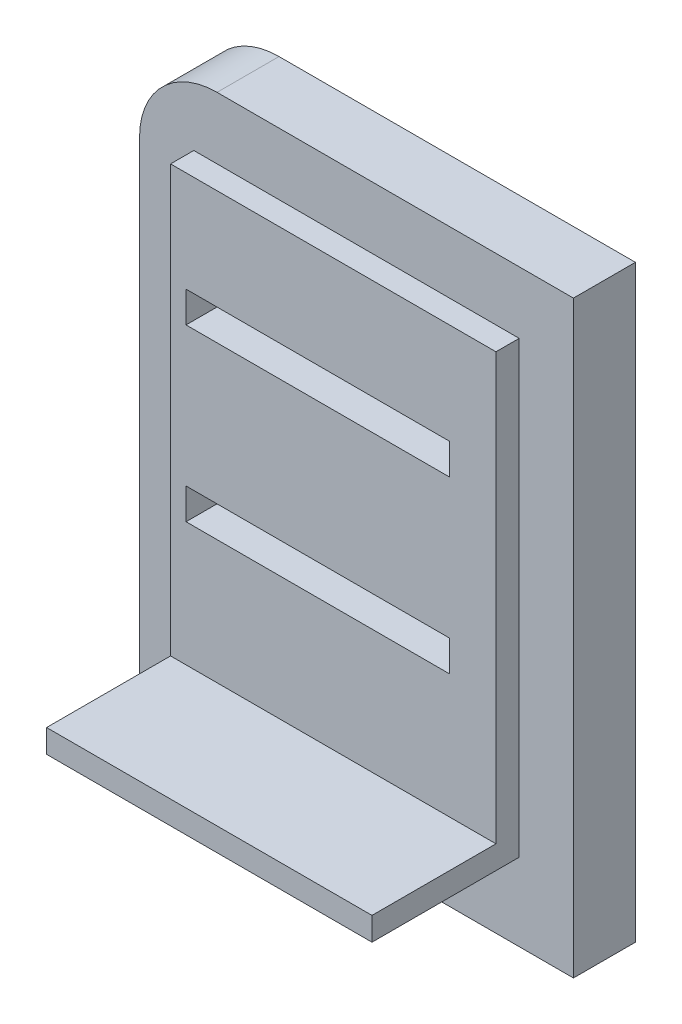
ISO-10303-21;
HEADER;
FILE_DESCRIPTION(('STEP AP214'),'2;1');
FILE_NAME('part.step','',(''),(''),'','','');
FILE_SCHEMA(('AUTOMOTIVE_DESIGN { 1 0 10303 214 1 1 1 1 }'));
ENDSEC;
DATA;
#1=APPLICATION_CONTEXT('core data for automotive mechanical design processes');
#2=APPLICATION_PROTOCOL_DEFINITION('international standard','automotive_design',2000,#1);
#3=PRODUCT_CONTEXT('',#1,'mechanical');
#4=PRODUCT('Part','Part','',(#3));
#5=PRODUCT_RELATED_PRODUCT_CATEGORY('part','',(#4));
#6=PRODUCT_DEFINITION_FORMATION('','',#4);
#7=PRODUCT_DEFINITION_CONTEXT('part definition',#1,'design');
#8=PRODUCT_DEFINITION('design','',#6,#7);
#9=PRODUCT_DEFINITION_SHAPE('','',#8);
#10=(LENGTH_UNIT() NAMED_UNIT(*) SI_UNIT(.MILLI.,.METRE.));
#11=(NAMED_UNIT(*) PLANE_ANGLE_UNIT() SI_UNIT($,.RADIAN.));
#12=(NAMED_UNIT(*) SI_UNIT($,.STERADIAN.) SOLID_ANGLE_UNIT());
#13=UNCERTAINTY_MEASURE_WITH_UNIT(LENGTH_MEASURE(1.E-05),#10,'distance_accuracy_value','');
#14=(GEOMETRIC_REPRESENTATION_CONTEXT(3) GLOBAL_UNCERTAINTY_ASSIGNED_CONTEXT((#13)) GLOBAL_UNIT_ASSIGNED_CONTEXT((#10,
#11,#12)) REPRESENTATION_CONTEXT('',''));
#15=CARTESIAN_POINT('',(0.,0.,0.));
#16=DIRECTION('',(0.,0.,1.));
#17=DIRECTION('',(1.,0.,0.));
#18=AXIS2_PLACEMENT_3D('',#15,#16,#17);
#19=CARTESIAN_POINT('',(-14.,-19.,1.99999999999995));
#20=DIRECTION('',(0.,0.,1.));
#21=DIRECTION('',(1.,0.,0.));
#22=AXIS2_PLACEMENT_3D('',#19,#20,#21);
#23=PLANE('',#22);
#24=DIRECTION('',(-1.,0.,0.));
#25=VECTOR('',#24,1.);
#26=CARTESIAN_POINT('',(-14.,19.,1.99999999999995));
#27=LINE('',#26,#25);
#28=CARTESIAN_POINT('',(14.,19.,1.99999999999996));
#29=VERTEX_POINT('',#28);
#30=CARTESIAN_POINT('',(-9.00000000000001,19.,2.));
#31=VERTEX_POINT('',#30);
#32=EDGE_CURVE('E322',#29,#31,#27,.T.);
#33=ORIENTED_EDGE('',*,*,#32,.T.);
#34=CARTESIAN_POINT('',(-9.00000000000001,14.,2.));
#35=DIRECTION('',(0.,0.,1.));
#36=DIRECTION('',(1.,0.,0.));
#37=AXIS2_PLACEMENT_3D('',#34,#35,#36);
#38=CIRCLE('',#37,5.);
#39=CARTESIAN_POINT('',(-14.,14.,1.99999999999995));
#40=VERTEX_POINT('',#39);
#41=EDGE_CURVE('E11',#31,#40,#38,.T.);
#42=ORIENTED_EDGE('',*,*,#41,.T.);
#43=DIRECTION('',(0.,-1.,0.));
#44=VECTOR('',#43,1.);
#45=CARTESIAN_POINT('',(-14.,19.,1.99999999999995));
#46=LINE('',#45,#44);
#47=CARTESIAN_POINT('',(-14.,-19.,1.99999999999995));
#48=VERTEX_POINT('',#47);
#49=EDGE_CURVE('E329',#40,#48,#46,.T.);
#50=ORIENTED_EDGE('',*,*,#49,.T.);
#51=DIRECTION('',(1.,0.,0.));
#52=VECTOR('',#51,1.);
#53=CARTESIAN_POINT('',(-14.,-19.,1.99999999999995));
#54=LINE('',#53,#52);
#55=CARTESIAN_POINT('',(14.,-19.,1.99999999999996));
#56=VERTEX_POINT('',#55);
#57=EDGE_CURVE('E327',#48,#56,#54,.T.);
#58=ORIENTED_EDGE('',*,*,#57,.T.);
#59=DIRECTION('',(0.,1.,0.));
#60=VECTOR('',#59,1.);
#61=CARTESIAN_POINT('',(14.,19.,1.99999999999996));
#62=LINE('',#61,#60);
#63=EDGE_CURVE('E325',#56,#29,#62,.T.);
#64=ORIENTED_EDGE('',*,*,#63,.T.);
#65=EDGE_LOOP('',(#33,#42,#50,#58,#64));
#66=FACE_BOUND('',#65,.T.);
#67=DIRECTION('',(1.,0.,0.));
#68=VECTOR('',#67,1.);
#69=CARTESIAN_POINT('',(-10.5,-14.,1.99999999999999));
#70=LINE('',#69,#68);
#71=CARTESIAN_POINT('',(-10.5,-14.,1.99999999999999));
#72=VERTEX_POINT('',#71);
#73=CARTESIAN_POINT('',(10.5,-14.,1.99999999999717));
#74=VERTEX_POINT('',#73);
#75=EDGE_CURVE('E287',#72,#74,#70,.T.);
#76=ORIENTED_EDGE('',*,*,#75,.F.);
#77=DIRECTION('',(0.,-1.,0.));
#78=VECTOR('',#77,1.);
#79=CARTESIAN_POINT('',(-10.5,15.,1.99999999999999));
#80=LINE('',#79,#78);
#81=CARTESIAN_POINT('',(-10.5,15.,1.99999999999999));
#82=VERTEX_POINT('',#81);
#83=EDGE_CURVE('E283',#82,#72,#80,.T.);
#84=ORIENTED_EDGE('',*,*,#83,.F.);
#85=DIRECTION('',(-1.,0.,0.));
#86=VECTOR('',#85,1.);
#87=CARTESIAN_POINT('',(-10.5,15.,1.99999999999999));
#88=LINE('',#87,#86);
#89=CARTESIAN_POINT('',(10.5,15.,1.99999999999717));
#90=VERTEX_POINT('',#89);
#91=EDGE_CURVE('E300',#90,#82,#88,.T.);
#92=ORIENTED_EDGE('',*,*,#91,.F.);
#93=DIRECTION('',(0.,1.,0.));
#94=VECTOR('',#93,1.);
#95=CARTESIAN_POINT('',(10.5,15.,1.99999999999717));
#96=LINE('',#95,#94);
#97=EDGE_CURVE('E293',#74,#90,#96,.T.);
#98=ORIENTED_EDGE('',*,*,#97,.F.);
#99=EDGE_LOOP('',(#76,#84,#92,#98));
#100=FACE_BOUND('',#99,.T.);
#101=ADVANCED_FACE('F33',(#66,#100),#23,.T.);
#102=CARTESIAN_POINT('',(-14.,19.,1.99999999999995));
#103=DIRECTION('',(1.,0.,0.));
#104=DIRECTION('',(0.,0.,-1.));
#105=AXIS2_PLACEMENT_3D('',#102,#103,#104);
#106=PLANE('',#105);
#107=ORIENTED_EDGE('',*,*,#49,.F.);
#108=DIRECTION('',(0.,0.,-1.));
#109=VECTOR('',#108,1.);
#110=CARTESIAN_POINT('',(-14.,14.,1.99999999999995));
#111=LINE('',#110,#109);
#112=CARTESIAN_POINT('',(-14.,14.,-2.00000000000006));
#113=VERTEX_POINT('',#112);
#114=EDGE_CURVE('E310',#40,#113,#111,.T.);
#115=ORIENTED_EDGE('',*,*,#114,.T.);
#116=DIRECTION('',(0.,-1.,0.));
#117=VECTOR('',#116,1.);
#118=CARTESIAN_POINT('',(-14.,19.,-2.00000000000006));
#119=LINE('',#118,#117);
#120=CARTESIAN_POINT('',(-14.,-19.,-2.00000000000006));
#121=VERTEX_POINT('',#120);
#122=EDGE_CURVE('E338',#113,#121,#119,.T.);
#123=ORIENTED_EDGE('',*,*,#122,.T.);
#124=DIRECTION('',(0.,0.,-1.));
#125=VECTOR('',#124,1.);
#126=CARTESIAN_POINT('',(-14.,-19.,1.99999999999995));
#127=LINE('',#126,#125);
#128=EDGE_CURVE('E313',#48,#121,#127,.T.);
#129=ORIENTED_EDGE('',*,*,#128,.F.);
#130=EDGE_LOOP('',(#107,#115,#123,#129));
#131=FACE_BOUND('',#130,.T.);
#132=ADVANCED_FACE('F35',(#131),#106,.F.);
#133=CARTESIAN_POINT('',(-14.,-19.,1.99999999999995));
#134=DIRECTION('',(0.,1.,0.));
#135=DIRECTION('',(0.,0.,1.));
#136=AXIS2_PLACEMENT_3D('',#133,#134,#135);
#137=PLANE('',#136);
#138=DIRECTION('',(1.,0.,0.));
#139=VECTOR('',#138,1.);
#140=CARTESIAN_POINT('',(-14.,-19.,-2.00000000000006));
#141=LINE('',#140,#139);
#142=CARTESIAN_POINT('',(14.,-19.,-2.00000000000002));
#143=VERTEX_POINT('',#142);
#144=EDGE_CURVE('E336',#121,#143,#141,.T.);
#145=ORIENTED_EDGE('',*,*,#144,.T.);
#146=DIRECTION('',(0.,0.,-1.));
#147=VECTOR('',#146,1.);
#148=CARTESIAN_POINT('',(14.,-19.,1.99999999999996));
#149=LINE('',#148,#147);
#150=EDGE_CURVE('E316',#56,#143,#149,.T.);
#151=ORIENTED_EDGE('',*,*,#150,.F.);
#152=ORIENTED_EDGE('',*,*,#57,.F.);
#153=ORIENTED_EDGE('',*,*,#128,.T.);
#154=EDGE_LOOP('',(#145,#151,#152,#153));
#155=FACE_BOUND('',#154,.T.);
#156=ADVANCED_FACE('F429',(#155),#137,.F.);
#157=CARTESIAN_POINT('',(14.,19.,1.99999999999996));
#158=DIRECTION('',(-1.,0.,0.));
#159=DIRECTION('',(0.,0.,1.));
#160=AXIS2_PLACEMENT_3D('',#157,#158,#159);
#161=PLANE('',#160);
#162=DIRECTION('',(0.,1.,0.));
#163=VECTOR('',#162,1.);
#164=CARTESIAN_POINT('',(14.,19.,-2.00000000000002));
#165=LINE('',#164,#163);
#166=CARTESIAN_POINT('',(14.,19.,-2.00000000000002));
#167=VERTEX_POINT('',#166);
#168=EDGE_CURVE('E334',#143,#167,#165,.T.);
#169=ORIENTED_EDGE('',*,*,#168,.T.);
#170=DIRECTION('',(0.,0.,-1.));
#171=VECTOR('',#170,1.);
#172=CARTESIAN_POINT('',(14.,19.,1.99999999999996));
#173=LINE('',#172,#171);
#174=EDGE_CURVE('E319',#29,#167,#173,.T.);
#175=ORIENTED_EDGE('',*,*,#174,.F.);
#176=ORIENTED_EDGE('',*,*,#63,.F.);
#177=ORIENTED_EDGE('',*,*,#150,.T.);
#178=EDGE_LOOP('',(#169,#175,#176,#177));
#179=FACE_BOUND('',#178,.T.);
#180=ADVANCED_FACE('F438',(#179),#161,.F.);
#181=CARTESIAN_POINT('',(-14.,19.,1.99999999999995));
#182=DIRECTION('',(0.,-1.,0.));
#183=DIRECTION('',(0.,0.,-1.));
#184=AXIS2_PLACEMENT_3D('',#181,#182,#183);
#185=PLANE('',#184);
#186=DIRECTION('',(-1.,0.,0.));
#187=VECTOR('',#186,1.);
#188=CARTESIAN_POINT('',(-14.,19.,-2.00000000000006));
#189=LINE('',#188,#187);
#190=CARTESIAN_POINT('',(-8.99999999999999,19.,-2.));
#191=VERTEX_POINT('',#190);
#192=EDGE_CURVE('E331',#167,#191,#189,.T.);
#193=ORIENTED_EDGE('',*,*,#192,.T.);
#194=DIRECTION('',(0.,0.,-1.));
#195=VECTOR('',#194,1.);
#196=CARTESIAN_POINT('',(-9.00000000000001,19.,2.));
#197=LINE('',#196,#195);
#198=EDGE_CURVE('E42',#191,#31,#197,.F.);
#199=ORIENTED_EDGE('',*,*,#198,.T.);
#200=ORIENTED_EDGE('',*,*,#32,.F.);
#201=ORIENTED_EDGE('',*,*,#174,.T.);
#202=EDGE_LOOP('',(#193,#199,#200,#201));
#203=FACE_BOUND('',#202,.T.);
#204=ADVANCED_FACE('F435',(#203),#185,.F.);
#205=CARTESIAN_POINT('',(-14.,-19.,-2.00000000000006));
#206=DIRECTION('',(0.,0.,1.));
#207=DIRECTION('',(1.,0.,0.));
#208=AXIS2_PLACEMENT_3D('',#205,#206,#207);
#209=PLANE('',#208);
#210=CARTESIAN_POINT('',(-8.99999999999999,14.,-2.));
#211=DIRECTION('',(0.,0.,1.));
#212=DIRECTION('',(1.,0.,0.));
#213=AXIS2_PLACEMENT_3D('',#210,#211,#212);
#214=CIRCLE('',#213,3.);
#215=CARTESIAN_POINT('',(-12.,14.,-2.00000000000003));
#216=VERTEX_POINT('',#215);
#217=CARTESIAN_POINT('',(-8.99999999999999,17.,-2.));
#218=VERTEX_POINT('',#217);
#219=EDGE_CURVE('E352',#216,#218,#214,.F.);
#220=ORIENTED_EDGE('',*,*,#219,.F.);
#221=DIRECTION('',(0.,-1.,0.));
#222=VECTOR('',#221,1.);
#223=CARTESIAN_POINT('',(-12.,19.,-2.00000000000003));
#224=LINE('',#223,#222);
#225=CARTESIAN_POINT('',(-12.,-17.,-2.00000000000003));
#226=VERTEX_POINT('',#225);
#227=EDGE_CURVE('E345',#216,#226,#224,.T.);
#228=ORIENTED_EDGE('',*,*,#227,.T.);
#229=DIRECTION('',(1.,0.,0.));
#230=VECTOR('',#229,1.);
#231=CARTESIAN_POINT('',(-14.,-17.,-2.00000000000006));
#232=LINE('',#231,#230);
#233=CARTESIAN_POINT('',(12.,-17.,-2.00000000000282));
#234=VERTEX_POINT('',#233);
#235=EDGE_CURVE('E341',#226,#234,#232,.T.);
#236=ORIENTED_EDGE('',*,*,#235,.T.);
#237=DIRECTION('',(0.,1.,0.));
#238=VECTOR('',#237,1.);
#239=CARTESIAN_POINT('',(12.,19.,-2.00000000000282));
#240=LINE('',#239,#238);
#241=CARTESIAN_POINT('',(12.,17.,-2.00000000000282));
#242=VERTEX_POINT('',#241);
#243=EDGE_CURVE('E344',#234,#242,#240,.T.);
#244=ORIENTED_EDGE('',*,*,#243,.T.);
#245=DIRECTION('',(-1.,0.,0.));
#246=VECTOR('',#245,1.);
#247=CARTESIAN_POINT('',(-14.,17.,-2.00000000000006));
#248=LINE('',#247,#246);
#249=EDGE_CURVE('E348',#242,#218,#248,.T.);
#250=ORIENTED_EDGE('',*,*,#249,.T.);
#251=EDGE_LOOP('',(#220,#228,#236,#244,#250));
#252=FACE_BOUND('',#251,.T.);
#253=ORIENTED_EDGE('',*,*,#122,.F.);
#254=CARTESIAN_POINT('',(-8.99999999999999,14.,-2.));
#255=DIRECTION('',(0.,0.,1.));
#256=DIRECTION('',(1.,0.,0.));
#257=AXIS2_PLACEMENT_3D('',#254,#255,#256);
#258=CIRCLE('',#257,5.);
#259=EDGE_CURVE('E308',#113,#191,#258,.F.);
#260=ORIENTED_EDGE('',*,*,#259,.T.);
#261=ORIENTED_EDGE('',*,*,#192,.F.);
#262=ORIENTED_EDGE('',*,*,#168,.F.);
#263=ORIENTED_EDGE('',*,*,#144,.F.);
#264=EDGE_LOOP('',(#253,#260,#261,#262,#263));
#265=FACE_BOUND('',#264,.T.);
#266=ADVANCED_FACE('F433',(#252,#265),#209,.F.);
#267=CARTESIAN_POINT('',(-9.00000000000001,14.,2.));
#268=DIRECTION('',(0.,0.,-1.));
#269=DIRECTION('',(-1.,0.,0.));
#270=AXIS2_PLACEMENT_3D('',#267,#268,#269);
#271=CYLINDRICAL_SURFACE('',#270,5.);
#272=ORIENTED_EDGE('',*,*,#41,.F.);
#273=ORIENTED_EDGE('',*,*,#198,.F.);
#274=ORIENTED_EDGE('',*,*,#259,.F.);
#275=ORIENTED_EDGE('',*,*,#114,.F.);
#276=EDGE_LOOP('',(#272,#273,#274,#275));
#277=FACE_BOUND('',#276,.T.);
#278=ADVANCED_FACE('F460',(#277),#271,.T.);
#279=CARTESIAN_POINT('',(-12.,19.,1.99999999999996));
#280=DIRECTION('',(1.,0.,0.));
#281=DIRECTION('',(0.,0.,-1.));
#282=AXIS2_PLACEMENT_3D('',#279,#280,#281);
#283=PLANE('',#282);
#284=DIRECTION('',(0.,-1.,0.));
#285=VECTOR('',#284,1.);
#286=CARTESIAN_POINT('',(-12.,19.,0.));
#287=LINE('',#286,#285);
#288=CARTESIAN_POINT('',(-12.,14.,0.));
#289=VERTEX_POINT('',#288);
#290=CARTESIAN_POINT('',(-12.,-17.,0.));
#291=VERTEX_POINT('',#290);
#292=EDGE_CURVE('E351',#289,#291,#287,.T.);
#293=ORIENTED_EDGE('',*,*,#292,.T.);
#294=DIRECTION('',(0.,0.,-1.));
#295=VECTOR('',#294,1.);
#296=CARTESIAN_POINT('',(-12.,-17.,1.99999999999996));
#297=LINE('',#296,#295);
#298=EDGE_CURVE('E373',#291,#226,#297,.T.);
#299=ORIENTED_EDGE('',*,*,#298,.T.);
#300=ORIENTED_EDGE('',*,*,#227,.F.);
#301=DIRECTION('',(0.,0.,-1.));
#302=VECTOR('',#301,1.);
#303=CARTESIAN_POINT('',(-12.,14.,1.99999999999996));
#304=LINE('',#303,#302);
#305=EDGE_CURVE('E355',#289,#216,#304,.T.);
#306=ORIENTED_EDGE('',*,*,#305,.F.);
#307=EDGE_LOOP('',(#293,#299,#300,#306));
#308=FACE_BOUND('',#307,.T.);
#309=ADVANCED_FACE('F464',(#308),#283,.T.);
#310=CARTESIAN_POINT('',(-14.,-17.,1.99999999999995));
#311=DIRECTION('',(0.,1.,0.));
#312=DIRECTION('',(0.,0.,1.));
#313=AXIS2_PLACEMENT_3D('',#310,#311,#312);
#314=PLANE('',#313);
#315=ORIENTED_EDGE('',*,*,#235,.F.);
#316=ORIENTED_EDGE('',*,*,#298,.F.);
#317=DIRECTION('',(1.,0.,0.));
#318=VECTOR('',#317,1.);
#319=CARTESIAN_POINT('',(-14.,-17.,-2.85882428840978E-12));
#320=LINE('',#319,#318);
#321=CARTESIAN_POINT('',(12.,-17.,-2.83106871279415E-12));
#322=VERTEX_POINT('',#321);
#323=EDGE_CURVE('E367',#291,#322,#320,.T.);
#324=ORIENTED_EDGE('',*,*,#323,.T.);
#325=DIRECTION('',(0.,0.,-1.));
#326=VECTOR('',#325,1.);
#327=CARTESIAN_POINT('',(12.,-17.,1.99999999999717));
#328=LINE('',#327,#326);
#329=EDGE_CURVE('E369',#322,#234,#328,.T.);
#330=ORIENTED_EDGE('',*,*,#329,.T.);
#331=EDGE_LOOP('',(#315,#316,#324,#330));
#332=FACE_BOUND('',#331,.T.);
#333=ADVANCED_FACE('F469',(#332),#314,.T.);
#334=CARTESIAN_POINT('',(12.,19.,1.99999999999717));
#335=DIRECTION('',(-1.,0.,0.));
#336=DIRECTION('',(0.,0.,1.));
#337=AXIS2_PLACEMENT_3D('',#334,#335,#336);
#338=PLANE('',#337);
#339=ORIENTED_EDGE('',*,*,#243,.F.);
#340=ORIENTED_EDGE('',*,*,#329,.F.);
#341=DIRECTION('',(0.,1.,0.));
#342=VECTOR('',#341,1.);
#343=CARTESIAN_POINT('',(12.,19.,-2.83106871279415E-12));
#344=LINE('',#343,#342);
#345=CARTESIAN_POINT('',(12.,17.,-2.83106871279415E-12));
#346=VERTEX_POINT('',#345);
#347=EDGE_CURVE('E364',#322,#346,#344,.T.);
#348=ORIENTED_EDGE('',*,*,#347,.T.);
#349=DIRECTION('',(0.,0.,-1.));
#350=VECTOR('',#349,1.);
#351=CARTESIAN_POINT('',(12.,17.,1.99999999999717));
#352=LINE('',#351,#350);
#353=EDGE_CURVE('E363',#346,#242,#352,.T.);
#354=ORIENTED_EDGE('',*,*,#353,.T.);
#355=EDGE_LOOP('',(#339,#340,#348,#354));
#356=FACE_BOUND('',#355,.T.);
#357=ADVANCED_FACE('F484',(#356),#338,.T.);
#358=CARTESIAN_POINT('',(-14.,17.,1.99999999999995));
#359=DIRECTION('',(0.,-1.,0.));
#360=DIRECTION('',(0.,0.,-1.));
#361=AXIS2_PLACEMENT_3D('',#358,#359,#360);
#362=PLANE('',#361);
#363=ORIENTED_EDGE('',*,*,#249,.F.);
#364=ORIENTED_EDGE('',*,*,#353,.F.);
#365=DIRECTION('',(-1.,0.,0.));
#366=VECTOR('',#365,1.);
#367=CARTESIAN_POINT('',(-14.,17.,-2.85882428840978E-12));
#368=LINE('',#367,#366);
#369=CARTESIAN_POINT('',(-9.00000000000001,17.,0.));
#370=VERTEX_POINT('',#369);
#371=EDGE_CURVE('E360',#346,#370,#368,.T.);
#372=ORIENTED_EDGE('',*,*,#371,.T.);
#373=DIRECTION('',(0.,0.,-1.));
#374=VECTOR('',#373,1.);
#375=CARTESIAN_POINT('',(-9.00000000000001,17.,2.));
#376=LINE('',#375,#374);
#377=EDGE_CURVE('E354',#218,#370,#376,.F.);
#378=ORIENTED_EDGE('',*,*,#377,.F.);
#379=EDGE_LOOP('',(#363,#364,#372,#378));
#380=FACE_BOUND('',#379,.T.);
#381=ADVANCED_FACE('F480',(#380),#362,.T.);
#382=CARTESIAN_POINT('',(-14.,-19.,-2.85882428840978E-12));
#383=DIRECTION('',(0.,0.,1.));
#384=DIRECTION('',(1.,0.,0.));
#385=AXIS2_PLACEMENT_3D('',#382,#383,#384);
#386=PLANE('',#385);
#387=DIRECTION('',(-1.,0.,0.));
#388=VECTOR('',#387,1.);
#389=CARTESIAN_POINT('',(-14.,8.5,-2.85882428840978E-12));
#390=LINE('',#389,#388);
#391=CARTESIAN_POINT('',(7.50000000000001,8.5,-2.85882428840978E-12));
#392=VERTEX_POINT('',#391);
#393=CARTESIAN_POINT('',(-9.50000000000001,8.5,0.));
#394=VERTEX_POINT('',#393);
#395=EDGE_CURVE('E226',#392,#394,#390,.T.);
#396=ORIENTED_EDGE('',*,*,#395,.T.);
#397=DIRECTION('',(0.,-1.,0.));
#398=VECTOR('',#397,1.);
#399=CARTESIAN_POINT('',(-9.50000000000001,-19.,0.));
#400=LINE('',#399,#398);
#401=CARTESIAN_POINT('',(-9.50000000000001,6.5,0.));
#402=VERTEX_POINT('',#401);
#403=EDGE_CURVE('E229',#394,#402,#400,.T.);
#404=ORIENTED_EDGE('',*,*,#403,.T.);
#405=DIRECTION('',(1.,0.,0.));
#406=VECTOR('',#405,1.);
#407=CARTESIAN_POINT('',(-14.,6.5,-2.85882428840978E-12));
#408=LINE('',#407,#406);
#409=CARTESIAN_POINT('',(7.50000000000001,6.5,-2.85882428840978E-12));
#410=VERTEX_POINT('',#409);
#411=EDGE_CURVE('E221',#402,#410,#408,.T.);
#412=ORIENTED_EDGE('',*,*,#411,.T.);
#413=DIRECTION('',(0.,1.,0.));
#414=VECTOR('',#413,1.);
#415=CARTESIAN_POINT('',(7.50000000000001,-19.,-2.85882428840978E-12));
#416=LINE('',#415,#414);
#417=EDGE_CURVE('E201',#410,#392,#416,.T.);
#418=ORIENTED_EDGE('',*,*,#417,.T.);
#419=EDGE_LOOP('',(#396,#404,#412,#418));
#420=FACE_BOUND('',#419,.T.);
#421=DIRECTION('',(-1.,0.,0.));
#422=VECTOR('',#421,1.);
#423=CARTESIAN_POINT('',(-14.,-2.5,-2.85882428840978E-12));
#424=LINE('',#423,#422);
#425=CARTESIAN_POINT('',(7.50000000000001,-2.5,-2.85882428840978E-12));
#426=VERTEX_POINT('',#425);
#427=CARTESIAN_POINT('',(-9.50000000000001,-2.5,0.));
#428=VERTEX_POINT('',#427);
#429=EDGE_CURVE('E258',#426,#428,#424,.T.);
#430=ORIENTED_EDGE('',*,*,#429,.T.);
#431=DIRECTION('',(0.,-1.,0.));
#432=VECTOR('',#431,1.);
#433=CARTESIAN_POINT('',(-9.50000000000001,-19.,0.));
#434=LINE('',#433,#432);
#435=CARTESIAN_POINT('',(-9.50000000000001,-4.5,0.));
#436=VERTEX_POINT('',#435);
#437=EDGE_CURVE('E261',#428,#436,#434,.T.);
#438=ORIENTED_EDGE('',*,*,#437,.T.);
#439=DIRECTION('',(1.,0.,0.));
#440=VECTOR('',#439,1.);
#441=CARTESIAN_POINT('',(-14.,-4.5,-2.85882428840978E-12));
#442=LINE('',#441,#440);
#443=CARTESIAN_POINT('',(7.50000000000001,-4.5,-2.85882428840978E-12));
#444=VERTEX_POINT('',#443);
#445=EDGE_CURVE('E246',#436,#444,#442,.T.);
#446=ORIENTED_EDGE('',*,*,#445,.T.);
#447=DIRECTION('',(0.,1.,0.));
#448=VECTOR('',#447,1.);
#449=CARTESIAN_POINT('',(7.50000000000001,-19.,-2.85882428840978E-12));
#450=LINE('',#449,#448);
#451=EDGE_CURVE('E255',#444,#426,#450,.T.);
#452=ORIENTED_EDGE('',*,*,#451,.T.);
#453=EDGE_LOOP('',(#430,#438,#446,#452));
#454=FACE_BOUND('',#453,.T.);
#455=ORIENTED_EDGE('',*,*,#371,.F.);
#456=ORIENTED_EDGE('',*,*,#347,.F.);
#457=ORIENTED_EDGE('',*,*,#323,.F.);
#458=ORIENTED_EDGE('',*,*,#292,.F.);
#459=CARTESIAN_POINT('',(-9.00000000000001,14.,0.));
#460=DIRECTION('',(0.,0.,1.));
#461=DIRECTION('',(1.,0.,0.));
#462=AXIS2_PLACEMENT_3D('',#459,#460,#461);
#463=CIRCLE('',#462,3.);
#464=EDGE_CURVE('E340',#370,#289,#463,.T.);
#465=ORIENTED_EDGE('',*,*,#464,.F.);
#466=EDGE_LOOP('',(#455,#456,#457,#458,#465));
#467=FACE_BOUND('',#466,.T.);
#468=ADVANCED_FACE('F476',(#420,#454,#467),#386,.F.);
#469=CARTESIAN_POINT('',(-9.00000000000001,14.,2.));
#470=DIRECTION('',(0.,0.,-1.));
#471=DIRECTION('',(-1.,0.,0.));
#472=AXIS2_PLACEMENT_3D('',#469,#470,#471);
#473=CYLINDRICAL_SURFACE('',#472,3.);
#474=ORIENTED_EDGE('',*,*,#464,.T.);
#475=ORIENTED_EDGE('',*,*,#305,.T.);
#476=ORIENTED_EDGE('',*,*,#219,.T.);
#477=ORIENTED_EDGE('',*,*,#377,.T.);
#478=EDGE_LOOP('',(#474,#475,#476,#477));
#479=FACE_BOUND('',#478,.T.);
#480=ADVANCED_FACE('F421',(#479),#473,.F.);
#481=CARTESIAN_POINT('',(-10.5,15.,3.49999999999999));
#482=DIRECTION('',(1.,0.,0.));
#483=DIRECTION('',(0.,1.,0.));
#484=AXIS2_PLACEMENT_3D('',#481,#482,#483);
#485=PLANE('',#484);
#486=ORIENTED_EDGE('',*,*,#83,.T.);
#487=DIRECTION('',(0.,0.,-1.));
#488=VECTOR('',#487,1.);
#489=CARTESIAN_POINT('',(-10.5,-14.,3.49999999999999));
#490=LINE('',#489,#488);
#491=CARTESIAN_POINT('',(-10.5,-14.,11.5));
#492=VERTEX_POINT('',#491);
#493=EDGE_CURVE('E358',#492,#72,#490,.T.);
#494=ORIENTED_EDGE('',*,*,#493,.F.);
#495=DIRECTION('',(0.,-1.,0.));
#496=VECTOR('',#495,1.);
#497=CARTESIAN_POINT('',(-10.5,-14.,11.5));
#498=LINE('',#497,#496);
#499=CARTESIAN_POINT('',(-10.5,-12.5,11.5));
#500=VERTEX_POINT('',#499);
#501=EDGE_CURVE('E405',#500,#492,#498,.T.);
#502=ORIENTED_EDGE('',*,*,#501,.F.);
#503=DIRECTION('',(0.,0.,-1.));
#504=VECTOR('',#503,1.);
#505=CARTESIAN_POINT('',(-10.5,-12.5,11.5));
#506=LINE('',#505,#504);
#507=CARTESIAN_POINT('',(-10.5,-12.5,3.49999999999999));
#508=VERTEX_POINT('',#507);
#509=EDGE_CURVE('E276',#500,#508,#506,.T.);
#510=ORIENTED_EDGE('',*,*,#509,.T.);
#511=DIRECTION('',(0.,-1.,0.));
#512=VECTOR('',#511,1.);
#513=CARTESIAN_POINT('',(-10.5,15.,3.49999999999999));
#514=LINE('',#513,#512);
#515=CARTESIAN_POINT('',(-10.5,15.,3.49999999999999));
#516=VERTEX_POINT('',#515);
#517=EDGE_CURVE('E302',#516,#508,#514,.T.);
#518=ORIENTED_EDGE('',*,*,#517,.F.);
#519=DIRECTION('',(0.,0.,-1.));
#520=VECTOR('',#519,1.);
#521=CARTESIAN_POINT('',(-10.5,15.,3.49999999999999));
#522=LINE('',#521,#520);
#523=EDGE_CURVE('E384',#516,#82,#522,.T.);
#524=ORIENTED_EDGE('',*,*,#523,.T.);
#525=EDGE_LOOP('',(#486,#494,#502,#510,#518,#524));
#526=FACE_BOUND('',#525,.T.);
#527=ADVANCED_FACE('F398',(#526),#485,.F.);
#528=CARTESIAN_POINT('',(-10.5,-14.,3.49999999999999));
#529=DIRECTION('',(0.,1.,0.));
#530=DIRECTION('',(-1.,0.,0.));
#531=AXIS2_PLACEMENT_3D('',#528,#529,#530);
#532=PLANE('',#531);
#533=ORIENTED_EDGE('',*,*,#75,.T.);
#534=DIRECTION('',(0.,0.,-1.));
#535=VECTOR('',#534,1.);
#536=CARTESIAN_POINT('',(10.5,-14.,3.49999999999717));
#537=LINE('',#536,#535);
#538=CARTESIAN_POINT('',(10.5,-14.,11.4999999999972));
#539=VERTEX_POINT('',#538);
#540=EDGE_CURVE('E379',#539,#74,#537,.T.);
#541=ORIENTED_EDGE('',*,*,#540,.F.);
#542=DIRECTION('',(1.,0.,0.));
#543=VECTOR('',#542,1.);
#544=CARTESIAN_POINT('',(10.5,-14.,11.4999999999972));
#545=LINE('',#544,#543);
#546=EDGE_CURVE('E280',#492,#539,#545,.T.);
#547=ORIENTED_EDGE('',*,*,#546,.F.);
#548=ORIENTED_EDGE('',*,*,#493,.T.);
#549=EDGE_LOOP('',(#533,#541,#547,#548));
#550=FACE_BOUND('',#549,.T.);
#551=ADVANCED_FACE('F413',(#550),#532,.F.);
#552=CARTESIAN_POINT('',(10.5,15.,3.49999999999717));
#553=DIRECTION('',(-1.,0.,0.));
#554=DIRECTION('',(0.,-1.,0.));
#555=AXIS2_PLACEMENT_3D('',#552,#553,#554);
#556=PLANE('',#555);
#557=ORIENTED_EDGE('',*,*,#97,.T.);
#558=DIRECTION('',(0.,0.,-1.));
#559=VECTOR('',#558,1.);
#560=CARTESIAN_POINT('',(10.5,15.,3.49999999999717));
#561=LINE('',#560,#559);
#562=CARTESIAN_POINT('',(10.5,15.,3.49999999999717));
#563=VERTEX_POINT('',#562);
#564=EDGE_CURVE('E382',#563,#90,#561,.T.);
#565=ORIENTED_EDGE('',*,*,#564,.F.);
#566=DIRECTION('',(0.,1.,0.));
#567=VECTOR('',#566,1.);
#568=CARTESIAN_POINT('',(10.5,15.,3.49999999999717));
#569=LINE('',#568,#567);
#570=CARTESIAN_POINT('',(10.5,-12.5,3.49999999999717));
#571=VERTEX_POINT('',#570);
#572=EDGE_CURVE('E273',#571,#563,#569,.T.);
#573=ORIENTED_EDGE('',*,*,#572,.F.);
#574=DIRECTION('',(0.,0.,-1.));
#575=VECTOR('',#574,1.);
#576=CARTESIAN_POINT('',(10.5,-12.5,11.4999999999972));
#577=LINE('',#576,#575);
#578=CARTESIAN_POINT('',(10.5,-12.5,11.4999999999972));
#579=VERTEX_POINT('',#578);
#580=EDGE_CURVE('E279',#579,#571,#577,.T.);
#581=ORIENTED_EDGE('',*,*,#580,.F.);
#582=DIRECTION('',(0.,1.,0.));
#583=VECTOR('',#582,1.);
#584=CARTESIAN_POINT('',(10.5,-14.,11.4999999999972));
#585=LINE('',#584,#583);
#586=EDGE_CURVE('E267',#539,#579,#585,.T.);
#587=ORIENTED_EDGE('',*,*,#586,.F.);
#588=ORIENTED_EDGE('',*,*,#540,.T.);
#589=EDGE_LOOP('',(#557,#565,#573,#581,#587,#588));
#590=FACE_BOUND('',#589,.T.);
#591=ADVANCED_FACE('F392',(#590),#556,.F.);
#592=CARTESIAN_POINT('',(-10.5,15.,3.49999999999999));
#593=DIRECTION('',(0.,-1.,0.));
#594=DIRECTION('',(1.,0.,0.));
#595=AXIS2_PLACEMENT_3D('',#592,#593,#594);
#596=PLANE('',#595);
#597=ORIENTED_EDGE('',*,*,#91,.T.);
#598=ORIENTED_EDGE('',*,*,#523,.F.);
#599=DIRECTION('',(-1.,0.,0.));
#600=VECTOR('',#599,1.);
#601=CARTESIAN_POINT('',(-10.5,15.,3.49999999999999));
#602=LINE('',#601,#600);
#603=EDGE_CURVE('E385',#563,#516,#602,.T.);
#604=ORIENTED_EDGE('',*,*,#603,.F.);
#605=ORIENTED_EDGE('',*,*,#564,.T.);
#606=EDGE_LOOP('',(#597,#598,#604,#605));
#607=FACE_BOUND('',#606,.T.);
#608=ADVANCED_FACE('F396',(#607),#596,.F.);
#609=CARTESIAN_POINT('',(-10.5,-14.,3.49999999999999));
#610=DIRECTION('',(0.,0.,1.));
#611=DIRECTION('',(1.,0.,0.));
#612=AXIS2_PLACEMENT_3D('',#609,#610,#611);
#613=PLANE('',#612);
#614=DIRECTION('',(0.,-1.,0.));
#615=VECTOR('',#614,1.);
#616=CARTESIAN_POINT('',(-9.50000000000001,8.5,3.49999999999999));
#617=LINE('',#616,#615);
#618=CARTESIAN_POINT('',(-9.50000000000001,8.5,3.49999999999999));
#619=VERTEX_POINT('',#618);
#620=CARTESIAN_POINT('',(-9.50000000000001,6.5,3.49999999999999));
#621=VERTEX_POINT('',#620);
#622=EDGE_CURVE('E58',#619,#621,#617,.T.);
#623=ORIENTED_EDGE('',*,*,#622,.F.);
#624=DIRECTION('',(-1.,0.,0.));
#625=VECTOR('',#624,1.);
#626=CARTESIAN_POINT('',(-9.50000000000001,8.5,3.49999999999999));
#627=LINE('',#626,#625);
#628=CARTESIAN_POINT('',(7.49999999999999,8.5,3.49999999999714));
#629=VERTEX_POINT('',#628);
#630=EDGE_CURVE('E214',#629,#619,#627,.T.);
#631=ORIENTED_EDGE('',*,*,#630,.F.);
#632=DIRECTION('',(0.,1.,0.));
#633=VECTOR('',#632,1.);
#634=CARTESIAN_POINT('',(7.49999999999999,8.5,3.49999999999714));
#635=LINE('',#634,#633);
#636=CARTESIAN_POINT('',(7.49999999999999,6.5,3.49999999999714));
#637=VERTEX_POINT('',#636);
#638=EDGE_CURVE('E198',#637,#629,#635,.T.);
#639=ORIENTED_EDGE('',*,*,#638,.F.);
#640=DIRECTION('',(1.,0.,0.));
#641=VECTOR('',#640,1.);
#642=CARTESIAN_POINT('',(-9.50000000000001,6.5,3.49999999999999));
#643=LINE('',#642,#641);
#644=EDGE_CURVE('E207',#621,#637,#643,.T.);
#645=ORIENTED_EDGE('',*,*,#644,.F.);
#646=EDGE_LOOP('',(#623,#631,#639,#645));
#647=FACE_BOUND('',#646,.T.);
#648=DIRECTION('',(0.,-1.,0.));
#649=VECTOR('',#648,1.);
#650=CARTESIAN_POINT('',(-9.50000000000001,-2.5,3.49999999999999));
#651=LINE('',#650,#649);
#652=CARTESIAN_POINT('',(-9.50000000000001,-2.5,3.49999999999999));
#653=VERTEX_POINT('',#652);
#654=CARTESIAN_POINT('',(-9.50000000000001,-4.5,3.49999999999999));
#655=VERTEX_POINT('',#654);
#656=EDGE_CURVE('E232',#653,#655,#651,.T.);
#657=ORIENTED_EDGE('',*,*,#656,.F.);
#658=DIRECTION('',(-1.,0.,0.));
#659=VECTOR('',#658,1.);
#660=CARTESIAN_POINT('',(-9.50000000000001,-2.5,3.49999999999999));
#661=LINE('',#660,#659);
#662=CARTESIAN_POINT('',(7.49999999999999,-2.5,3.49999999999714));
#663=VERTEX_POINT('',#662);
#664=EDGE_CURVE('E240',#663,#653,#661,.T.);
#665=ORIENTED_EDGE('',*,*,#664,.F.);
#666=DIRECTION('',(0.,1.,0.));
#667=VECTOR('',#666,1.);
#668=CARTESIAN_POINT('',(7.49999999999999,-2.5,3.49999999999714));
#669=LINE('',#668,#667);
#670=CARTESIAN_POINT('',(7.49999999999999,-4.5,3.49999999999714));
#671=VERTEX_POINT('',#670);
#672=EDGE_CURVE('E237',#671,#663,#669,.T.);
#673=ORIENTED_EDGE('',*,*,#672,.F.);
#674=DIRECTION('',(1.,0.,0.));
#675=VECTOR('',#674,1.);
#676=CARTESIAN_POINT('',(-9.50000000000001,-4.5,3.49999999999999));
#677=LINE('',#676,#675);
#678=EDGE_CURVE('E234',#655,#671,#677,.T.);
#679=ORIENTED_EDGE('',*,*,#678,.F.);
#680=EDGE_LOOP('',(#657,#665,#673,#679));
#681=FACE_BOUND('',#680,.T.);
#682=DIRECTION('',(-1.,0.,0.));
#683=VECTOR('',#682,1.);
#684=CARTESIAN_POINT('',(10.5,-12.5,3.49999999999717));
#685=LINE('',#684,#683);
#686=EDGE_CURVE('E264',#571,#508,#685,.T.);
#687=ORIENTED_EDGE('',*,*,#686,.F.);
#688=ORIENTED_EDGE('',*,*,#572,.T.);
#689=ORIENTED_EDGE('',*,*,#603,.T.);
#690=ORIENTED_EDGE('',*,*,#517,.T.);
#691=EDGE_LOOP('',(#687,#688,#689,#690));
#692=FACE_BOUND('',#691,.T.);
#693=ADVANCED_FACE('F211',(#647,#681,#692),#613,.T.);
#694=CARTESIAN_POINT('',(10.5,-12.5,11.4999999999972));
#695=DIRECTION('',(0.,-1.,0.));
#696=DIRECTION('',(1.,0.,0.));
#697=AXIS2_PLACEMENT_3D('',#694,#695,#696);
#698=PLANE('',#697);
#699=ORIENTED_EDGE('',*,*,#686,.T.);
#700=ORIENTED_EDGE('',*,*,#509,.F.);
#701=DIRECTION('',(-1.,0.,0.));
#702=VECTOR('',#701,1.);
#703=CARTESIAN_POINT('',(10.5,-12.5,11.4999999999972));
#704=LINE('',#703,#702);
#705=EDGE_CURVE('E402',#579,#500,#704,.T.);
#706=ORIENTED_EDGE('',*,*,#705,.F.);
#707=ORIENTED_EDGE('',*,*,#580,.T.);
#708=EDGE_LOOP('',(#699,#700,#706,#707));
#709=FACE_BOUND('',#708,.T.);
#710=ADVANCED_FACE('F401',(#709),#698,.F.);
#711=CARTESIAN_POINT('',(10.5,-12.5,11.4999999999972));
#712=DIRECTION('',(0.,0.,1.));
#713=DIRECTION('',(1.,0.,0.));
#714=AXIS2_PLACEMENT_3D('',#711,#712,#713);
#715=PLANE('',#714);
#716=ORIENTED_EDGE('',*,*,#586,.T.);
#717=ORIENTED_EDGE('',*,*,#705,.T.);
#718=ORIENTED_EDGE('',*,*,#501,.T.);
#719=ORIENTED_EDGE('',*,*,#546,.T.);
#720=EDGE_LOOP('',(#716,#717,#718,#719));
#721=FACE_BOUND('',#720,.T.);
#722=ADVANCED_FACE('F410',(#721),#715,.T.);
#723=CARTESIAN_POINT('',(-9.49999999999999,-2.5,-2.));
#724=DIRECTION('',(-1.,0.,0.));
#725=DIRECTION('',(0.,0.,1.));
#726=AXIS2_PLACEMENT_3D('',#723,#724,#725);
#727=PLANE('',#726);
#728=DIRECTION('',(0.,0.,1.));
#729=VECTOR('',#728,1.);
#730=CARTESIAN_POINT('',(-9.49999999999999,-2.5,-2.));
#731=LINE('',#730,#729);
#732=EDGE_CURVE('E244',#428,#653,#731,.T.);
#733=ORIENTED_EDGE('',*,*,#732,.T.);
#734=ORIENTED_EDGE('',*,*,#656,.T.);
#735=DIRECTION('',(0.,0.,1.));
#736=VECTOR('',#735,1.);
#737=CARTESIAN_POINT('',(-9.49999999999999,-4.5,-2.));
#738=LINE('',#737,#736);
#739=EDGE_CURVE('E243',#436,#655,#738,.T.);
#740=ORIENTED_EDGE('',*,*,#739,.F.);
#741=ORIENTED_EDGE('',*,*,#437,.F.);
#742=EDGE_LOOP('',(#733,#734,#740,#741));
#743=FACE_BOUND('',#742,.T.);
#744=ADVANCED_FACE('F575',(#743),#727,.F.);
#745=CARTESIAN_POINT('',(-9.49999999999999,-2.5,-2.));
#746=DIRECTION('',(0.,1.,0.));
#747=DIRECTION('',(0.,0.,1.));
#748=AXIS2_PLACEMENT_3D('',#745,#746,#747);
#749=PLANE('',#748);
#750=DIRECTION('',(0.,0.,1.));
#751=VECTOR('',#750,1.);
#752=CARTESIAN_POINT('',(7.50000000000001,-2.5,-2.00000000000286));
#753=LINE('',#752,#751);
#754=EDGE_CURVE('E247',#426,#663,#753,.T.);
#755=ORIENTED_EDGE('',*,*,#754,.T.);
#756=ORIENTED_EDGE('',*,*,#664,.T.);
#757=ORIENTED_EDGE('',*,*,#732,.F.);
#758=ORIENTED_EDGE('',*,*,#429,.F.);
#759=EDGE_LOOP('',(#755,#756,#757,#758));
#760=FACE_BOUND('',#759,.T.);
#761=ADVANCED_FACE('F584',(#760),#749,.F.);
#762=CARTESIAN_POINT('',(7.50000000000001,-2.5,-2.00000000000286));
#763=DIRECTION('',(1.,0.,0.));
#764=DIRECTION('',(0.,0.,-1.));
#765=AXIS2_PLACEMENT_3D('',#762,#763,#764);
#766=PLANE('',#765);
#767=DIRECTION('',(0.,0.,1.));
#768=VECTOR('',#767,1.);
#769=CARTESIAN_POINT('',(7.50000000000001,-4.5,-2.00000000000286));
#770=LINE('',#769,#768);
#771=EDGE_CURVE('E249',#444,#671,#770,.T.);
#772=ORIENTED_EDGE('',*,*,#771,.T.);
#773=ORIENTED_EDGE('',*,*,#672,.T.);
#774=ORIENTED_EDGE('',*,*,#754,.F.);
#775=ORIENTED_EDGE('',*,*,#451,.F.);
#776=EDGE_LOOP('',(#772,#773,#774,#775));
#777=FACE_BOUND('',#776,.T.);
#778=ADVANCED_FACE('F594',(#777),#766,.F.);
#779=CARTESIAN_POINT('',(-9.49999999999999,-4.5,-2.));
#780=DIRECTION('',(0.,-1.,0.));
#781=DIRECTION('',(0.,0.,-1.));
#782=AXIS2_PLACEMENT_3D('',#779,#780,#781);
#783=PLANE('',#782);
#784=ORIENTED_EDGE('',*,*,#739,.T.);
#785=ORIENTED_EDGE('',*,*,#678,.T.);
#786=ORIENTED_EDGE('',*,*,#771,.F.);
#787=ORIENTED_EDGE('',*,*,#445,.F.);
#788=EDGE_LOOP('',(#784,#785,#786,#787));
#789=FACE_BOUND('',#788,.T.);
#790=ADVANCED_FACE('F604',(#789),#783,.F.);
#791=CARTESIAN_POINT('',(-9.49999999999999,8.5,-2.));
#792=DIRECTION('',(-1.,0.,0.));
#793=DIRECTION('',(0.,0.,1.));
#794=AXIS2_PLACEMENT_3D('',#791,#792,#793);
#795=PLANE('',#794);
#796=DIRECTION('',(0.,0.,1.));
#797=VECTOR('',#796,1.);
#798=CARTESIAN_POINT('',(-9.49999999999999,8.5,-2.));
#799=LINE('',#798,#797);
#800=EDGE_CURVE('E219',#394,#619,#799,.T.);
#801=ORIENTED_EDGE('',*,*,#800,.T.);
#802=ORIENTED_EDGE('',*,*,#622,.T.);
#803=DIRECTION('',(0.,0.,1.));
#804=VECTOR('',#803,1.);
#805=CARTESIAN_POINT('',(-9.49999999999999,6.5,-2.));
#806=LINE('',#805,#804);
#807=EDGE_CURVE('E204',#402,#621,#806,.T.);
#808=ORIENTED_EDGE('',*,*,#807,.F.);
#809=ORIENTED_EDGE('',*,*,#403,.F.);
#810=EDGE_LOOP('',(#801,#802,#808,#809));
#811=FACE_BOUND('',#810,.T.);
#812=ADVANCED_FACE('F614',(#811),#795,.F.);
#813=CARTESIAN_POINT('',(-9.49999999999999,8.5,-2.));
#814=DIRECTION('',(0.,1.,0.));
#815=DIRECTION('',(0.,0.,1.));
#816=AXIS2_PLACEMENT_3D('',#813,#814,#815);
#817=PLANE('',#816);
#818=DIRECTION('',(0.,0.,1.));
#819=VECTOR('',#818,1.);
#820=CARTESIAN_POINT('',(7.50000000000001,8.5,-2.00000000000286));
#821=LINE('',#820,#819);
#822=EDGE_CURVE('E203',#392,#629,#821,.T.);
#823=ORIENTED_EDGE('',*,*,#822,.T.);
#824=ORIENTED_EDGE('',*,*,#630,.T.);
#825=ORIENTED_EDGE('',*,*,#800,.F.);
#826=ORIENTED_EDGE('',*,*,#395,.F.);
#827=EDGE_LOOP('',(#823,#824,#825,#826));
#828=FACE_BOUND('',#827,.T.);
#829=ADVANCED_FACE('F624',(#828),#817,.F.);
#830=CARTESIAN_POINT('',(7.50000000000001,8.5,-2.00000000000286));
#831=DIRECTION('',(1.,0.,0.));
#832=DIRECTION('',(0.,0.,-1.));
#833=AXIS2_PLACEMENT_3D('',#830,#831,#832);
#834=PLANE('',#833);
#835=DIRECTION('',(0.,0.,1.));
#836=VECTOR('',#835,1.);
#837=CARTESIAN_POINT('',(7.50000000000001,6.5,-2.00000000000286));
#838=LINE('',#837,#836);
#839=EDGE_CURVE('E50',#410,#637,#838,.T.);
#840=ORIENTED_EDGE('',*,*,#839,.T.);
#841=ORIENTED_EDGE('',*,*,#638,.T.);
#842=ORIENTED_EDGE('',*,*,#822,.F.);
#843=ORIENTED_EDGE('',*,*,#417,.F.);
#844=EDGE_LOOP('',(#840,#841,#842,#843));
#845=FACE_BOUND('',#844,.T.);
#846=ADVANCED_FACE('F195',(#845),#834,.F.);
#847=CARTESIAN_POINT('',(-9.49999999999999,6.5,-2.));
#848=DIRECTION('',(0.,-1.,0.));
#849=DIRECTION('',(0.,0.,-1.));
#850=AXIS2_PLACEMENT_3D('',#847,#848,#849);
#851=PLANE('',#850);
#852=ORIENTED_EDGE('',*,*,#807,.T.);
#853=ORIENTED_EDGE('',*,*,#644,.T.);
#854=ORIENTED_EDGE('',*,*,#839,.F.);
#855=ORIENTED_EDGE('',*,*,#411,.F.);
#856=EDGE_LOOP('',(#852,#853,#854,#855));
#857=FACE_BOUND('',#856,.T.);
#858=ADVANCED_FACE('F208',(#857),#851,.F.);
#859=CLOSED_SHELL('',(#101,#132,#156,#180,#204,#266,#278,#309,#333,#357,#381,#468,#480,#527,
#551,#591,#608,#693,#710,#722,#744,#761,#778,#790,#812,#829,#846,#858));
#860=MANIFOLD_SOLID_BREP('B2',#859);
#861=ADVANCED_BREP_SHAPE_REPRESENTATION('',(#18,#860),#14);
#862=SHAPE_DEFINITION_REPRESENTATION(#9,#861);
ENDSEC;
END-ISO-10303-21;
